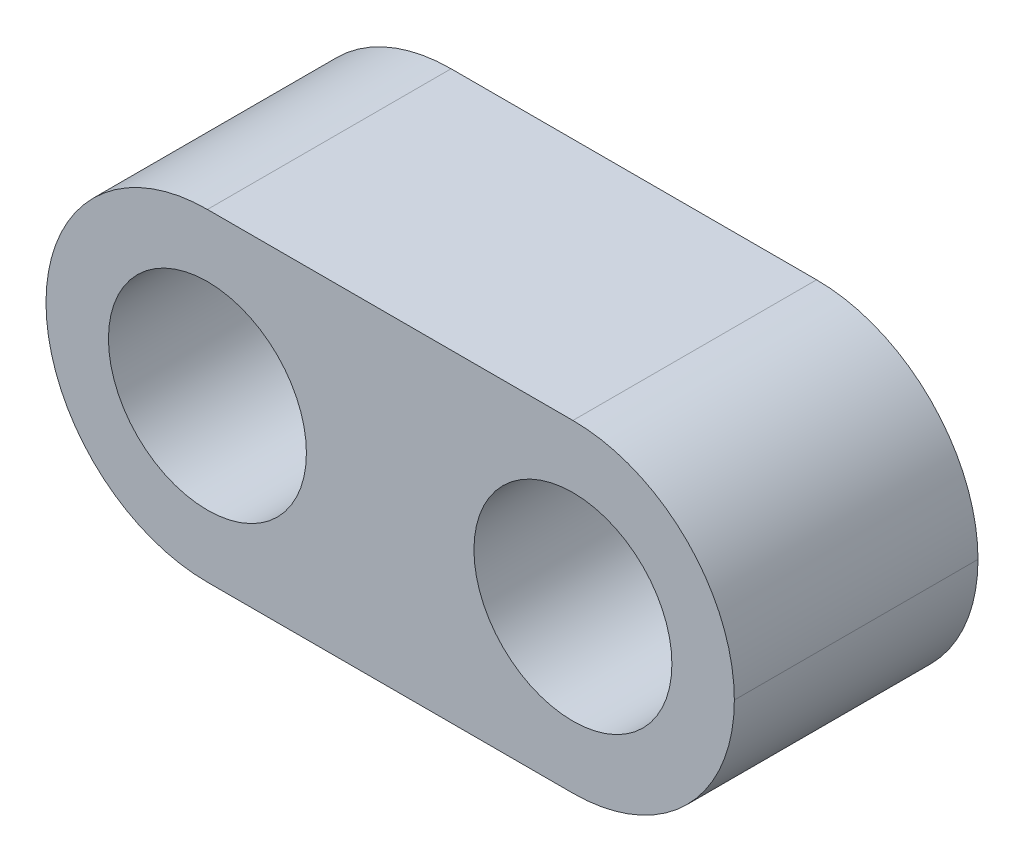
ISO-10303-21;
HEADER;
FILE_DESCRIPTION(('STEP AP214'),'2;1');
FILE_NAME('part.step','',(''),(''),'','','');
FILE_SCHEMA(('AUTOMOTIVE_DESIGN { 1 0 10303 214 1 1 1 1 }'));
ENDSEC;
DATA;
#1=APPLICATION_CONTEXT('core data for automotive mechanical design processes');
#2=APPLICATION_PROTOCOL_DEFINITION('international standard','automotive_design',2000,#1);
#3=PRODUCT_CONTEXT('',#1,'mechanical');
#4=PRODUCT('Part','Part','',(#3));
#5=PRODUCT_RELATED_PRODUCT_CATEGORY('part','',(#4));
#6=PRODUCT_DEFINITION_FORMATION('','',#4);
#7=PRODUCT_DEFINITION_CONTEXT('part definition',#1,'design');
#8=PRODUCT_DEFINITION('design','',#6,#7);
#9=PRODUCT_DEFINITION_SHAPE('','',#8);
#10=(LENGTH_UNIT() NAMED_UNIT(*) SI_UNIT(.MILLI.,.METRE.));
#11=(NAMED_UNIT(*) PLANE_ANGLE_UNIT() SI_UNIT($,.RADIAN.));
#12=(NAMED_UNIT(*) SI_UNIT($,.STERADIAN.) SOLID_ANGLE_UNIT());
#13=UNCERTAINTY_MEASURE_WITH_UNIT(LENGTH_MEASURE(1.E-05),#10,'distance_accuracy_value','');
#14=(GEOMETRIC_REPRESENTATION_CONTEXT(3) GLOBAL_UNCERTAINTY_ASSIGNED_CONTEXT((#13)) GLOBAL_UNIT_ASSIGNED_CONTEXT((#10,
#11,#12)) REPRESENTATION_CONTEXT('',''));
#15=CARTESIAN_POINT('',(0.,0.,0.));
#16=DIRECTION('',(0.,0.,1.));
#17=DIRECTION('',(1.,0.,0.));
#18=AXIS2_PLACEMENT_3D('',#15,#16,#17);
#19=CARTESIAN_POINT('',(-5.65,2.65,4.));
#20=DIRECTION('',(0.,-1.,0.));
#21=DIRECTION('',(0.,0.,-1.));
#22=AXIS2_PLACEMENT_3D('',#19,#20,#21);
#23=PLANE('',#22);
#24=DIRECTION('',(-1.,0.,0.));
#25=VECTOR('',#24,1.);
#26=CARTESIAN_POINT('',(-5.65,2.65,4.));
#27=LINE('',#26,#25);
#28=CARTESIAN_POINT('',(3.,2.65,4.));
#29=VERTEX_POINT('',#28);
#30=CARTESIAN_POINT('',(-3.,2.65,4.));
#31=VERTEX_POINT('',#30);
#32=EDGE_CURVE('E114',#29,#31,#27,.T.);
#33=ORIENTED_EDGE('',*,*,#32,.F.);
#34=DIRECTION('',(0.,0.,-1.));
#35=VECTOR('',#34,1.);
#36=CARTESIAN_POINT('',(3.,2.65,4.));
#37=LINE('',#36,#35);
#38=CARTESIAN_POINT('',(3.,2.65,0.));
#39=VERTEX_POINT('',#38);
#40=EDGE_CURVE('E98',#29,#39,#37,.T.);
#41=ORIENTED_EDGE('',*,*,#40,.T.);
#42=DIRECTION('',(-1.,0.,0.));
#43=VECTOR('',#42,1.);
#44=CARTESIAN_POINT('',(-5.65,2.65,0.));
#45=LINE('',#44,#43);
#46=CARTESIAN_POINT('',(-3.,2.65,0.));
#47=VERTEX_POINT('',#46);
#48=EDGE_CURVE('E111',#39,#47,#45,.T.);
#49=ORIENTED_EDGE('',*,*,#48,.T.);
#50=DIRECTION('',(0.,0.,-1.));
#51=VECTOR('',#50,1.);
#52=CARTESIAN_POINT('',(-3.,2.65,4.));
#53=LINE('',#52,#51);
#54=EDGE_CURVE('E117',#47,#31,#53,.F.);
#55=ORIENTED_EDGE('',*,*,#54,.T.);
#56=EDGE_LOOP('',(#33,#41,#49,#55));
#57=FACE_BOUND('',#56,.T.);
#58=ADVANCED_FACE('F39',(#57),#23,.F.);
#59=CARTESIAN_POINT('',(-5.65,-2.65,4.));
#60=DIRECTION('',(0.,1.,0.));
#61=DIRECTION('',(0.,0.,1.));
#62=AXIS2_PLACEMENT_3D('',#59,#60,#61);
#63=PLANE('',#62);
#64=DIRECTION('',(1.,0.,0.));
#65=VECTOR('',#64,1.);
#66=CARTESIAN_POINT('',(-5.65,-2.65,0.));
#67=LINE('',#66,#65);
#68=CARTESIAN_POINT('',(-3.,-2.65,0.));
#69=VERTEX_POINT('',#68);
#70=CARTESIAN_POINT('',(3.,-2.65,0.));
#71=VERTEX_POINT('',#70);
#72=EDGE_CURVE('E122',#69,#71,#67,.T.);
#73=ORIENTED_EDGE('',*,*,#72,.T.);
#74=DIRECTION('',(0.,0.,-1.));
#75=VECTOR('',#74,1.);
#76=CARTESIAN_POINT('',(3.,-2.65,4.));
#77=LINE('',#76,#75);
#78=CARTESIAN_POINT('',(3.,-2.65,4.));
#79=VERTEX_POINT('',#78);
#80=EDGE_CURVE('E11',#71,#79,#77,.F.);
#81=ORIENTED_EDGE('',*,*,#80,.T.);
#82=DIRECTION('',(1.,0.,0.));
#83=VECTOR('',#82,1.);
#84=CARTESIAN_POINT('',(-5.65,-2.65,4.));
#85=LINE('',#84,#83);
#86=CARTESIAN_POINT('',(-3.,-2.65,4.));
#87=VERTEX_POINT('',#86);
#88=EDGE_CURVE('E132',#87,#79,#85,.T.);
#89=ORIENTED_EDGE('',*,*,#88,.F.);
#90=DIRECTION('',(0.,0.,-1.));
#91=VECTOR('',#90,1.);
#92=CARTESIAN_POINT('',(-3.,-2.65,4.));
#93=LINE('',#92,#91);
#94=EDGE_CURVE('E49',#87,#69,#93,.T.);
#95=ORIENTED_EDGE('',*,*,#94,.T.);
#96=EDGE_LOOP('',(#73,#81,#89,#95));
#97=FACE_BOUND('',#96,.T.);
#98=ADVANCED_FACE('F201',(#97),#63,.F.);
#99=CARTESIAN_POINT('',(0.,0.,4.));
#100=DIRECTION('',(0.,0.,-1.));
#101=DIRECTION('',(-1.,0.,0.));
#102=AXIS2_PLACEMENT_3D('',#99,#100,#101);
#103=PLANE('',#102);
#104=CARTESIAN_POINT('',(-3.,0.,4.));
#105=DIRECTION('',(0.,0.,-1.));
#106=DIRECTION('',(-1.,0.,0.));
#107=AXIS2_PLACEMENT_3D('',#104,#105,#106);
#108=CIRCLE('',#107,1.625);
#109=CARTESIAN_POINT('',(-4.625,0.,4.));
#110=VERTEX_POINT('',#109);
#111=EDGE_CURVE('E123',#110,#110,#108,.T.);
#112=ORIENTED_EDGE('',*,*,#111,.T.);
#113=EDGE_LOOP('',(#112));
#114=FACE_BOUND('',#113,.T.);
#115=CARTESIAN_POINT('',(3.,0.,4.));
#116=DIRECTION('',(0.,0.,-1.));
#117=DIRECTION('',(-1.,0.,0.));
#118=AXIS2_PLACEMENT_3D('',#115,#116,#117);
#119=CIRCLE('',#118,1.625);
#120=CARTESIAN_POINT('',(1.375,0.,4.));
#121=VERTEX_POINT('',#120);
#122=EDGE_CURVE('E161',#121,#121,#119,.T.);
#123=ORIENTED_EDGE('',*,*,#122,.T.);
#124=EDGE_LOOP('',(#123));
#125=FACE_BOUND('',#124,.T.);
#126=CARTESIAN_POINT('',(3.,0.,4.));
#127=DIRECTION('',(0.,0.,-1.));
#128=DIRECTION('',(-1.,0.,0.));
#129=AXIS2_PLACEMENT_3D('',#126,#127,#128);
#130=CIRCLE('',#129,2.65);
#131=CARTESIAN_POINT('',(5.65,0.,4.));
#132=VERTEX_POINT('',#131);
#133=EDGE_CURVE('E148',#79,#132,#130,.F.);
#134=ORIENTED_EDGE('',*,*,#133,.T.);
#135=CARTESIAN_POINT('',(3.,0.,4.));
#136=DIRECTION('',(0.,0.,-1.));
#137=DIRECTION('',(-1.,0.,0.));
#138=AXIS2_PLACEMENT_3D('',#135,#136,#137);
#139=CIRCLE('',#138,2.65);
#140=EDGE_CURVE('E151',#132,#29,#139,.F.);
#141=ORIENTED_EDGE('',*,*,#140,.T.);
#142=ORIENTED_EDGE('',*,*,#32,.T.);
#143=CARTESIAN_POINT('',(-3.,0.,4.));
#144=DIRECTION('',(0.,0.,-1.));
#145=DIRECTION('',(-1.,0.,0.));
#146=AXIS2_PLACEMENT_3D('',#143,#144,#145);
#147=CIRCLE('',#146,2.65);
#148=CARTESIAN_POINT('',(-5.65,0.,4.));
#149=VERTEX_POINT('',#148);
#150=EDGE_CURVE('E105',#31,#149,#147,.F.);
#151=ORIENTED_EDGE('',*,*,#150,.T.);
#152=CARTESIAN_POINT('',(-3.,0.,4.));
#153=DIRECTION('',(0.,0.,-1.));
#154=DIRECTION('',(-1.,0.,0.));
#155=AXIS2_PLACEMENT_3D('',#152,#153,#154);
#156=CIRCLE('',#155,2.65);
#157=EDGE_CURVE('E62',#149,#87,#156,.F.);
#158=ORIENTED_EDGE('',*,*,#157,.T.);
#159=ORIENTED_EDGE('',*,*,#88,.T.);
#160=EDGE_LOOP('',(#134,#141,#142,#151,#158,#159));
#161=FACE_BOUND('',#160,.T.);
#162=ADVANCED_FACE('F170',(#114,#125,#161),#103,.F.);
#163=CARTESIAN_POINT('',(0.,0.,0.));
#164=DIRECTION('',(0.,0.,-1.));
#165=DIRECTION('',(-1.,0.,0.));
#166=AXIS2_PLACEMENT_3D('',#163,#164,#165);
#167=PLANE('',#166);
#168=CARTESIAN_POINT('',(-3.,0.,0.));
#169=DIRECTION('',(0.,0.,-1.));
#170=DIRECTION('',(-1.,0.,0.));
#171=AXIS2_PLACEMENT_3D('',#168,#169,#170);
#172=CIRCLE('',#171,1.625);
#173=CARTESIAN_POINT('',(-4.625,0.,0.));
#174=VERTEX_POINT('',#173);
#175=EDGE_CURVE('E129',#174,#174,#172,.T.);
#176=ORIENTED_EDGE('',*,*,#175,.F.);
#177=EDGE_LOOP('',(#176));
#178=FACE_BOUND('',#177,.T.);
#179=CARTESIAN_POINT('',(3.,0.,0.));
#180=DIRECTION('',(0.,0.,-1.));
#181=DIRECTION('',(-1.,0.,0.));
#182=AXIS2_PLACEMENT_3D('',#179,#180,#181);
#183=CIRCLE('',#182,1.625);
#184=CARTESIAN_POINT('',(1.375,0.,0.));
#185=VERTEX_POINT('',#184);
#186=EDGE_CURVE('E157',#185,#185,#183,.T.);
#187=ORIENTED_EDGE('',*,*,#186,.F.);
#188=EDGE_LOOP('',(#187));
#189=FACE_BOUND('',#188,.T.);
#190=ORIENTED_EDGE('',*,*,#48,.F.);
#191=CARTESIAN_POINT('',(3.,0.,0.));
#192=DIRECTION('',(0.,0.,-1.));
#193=DIRECTION('',(-1.,0.,0.));
#194=AXIS2_PLACEMENT_3D('',#191,#192,#193);
#195=CIRCLE('',#194,2.65);
#196=CARTESIAN_POINT('',(5.65,0.,0.));
#197=VERTEX_POINT('',#196);
#198=EDGE_CURVE('E94',#39,#197,#195,.T.);
#199=ORIENTED_EDGE('',*,*,#198,.T.);
#200=CARTESIAN_POINT('',(3.,0.,0.));
#201=DIRECTION('',(0.,0.,-1.));
#202=DIRECTION('',(-1.,0.,0.));
#203=AXIS2_PLACEMENT_3D('',#200,#201,#202);
#204=CIRCLE('',#203,2.65);
#205=EDGE_CURVE('E106',#197,#71,#204,.T.);
#206=ORIENTED_EDGE('',*,*,#205,.T.);
#207=ORIENTED_EDGE('',*,*,#72,.F.);
#208=CARTESIAN_POINT('',(-3.,0.,0.));
#209=DIRECTION('',(0.,0.,-1.));
#210=DIRECTION('',(-1.,0.,0.));
#211=AXIS2_PLACEMENT_3D('',#208,#209,#210);
#212=CIRCLE('',#211,2.65);
#213=CARTESIAN_POINT('',(-5.65,0.,0.));
#214=VERTEX_POINT('',#213);
#215=EDGE_CURVE('E139',#69,#214,#212,.T.);
#216=ORIENTED_EDGE('',*,*,#215,.T.);
#217=CARTESIAN_POINT('',(-3.,0.,0.));
#218=DIRECTION('',(0.,0.,-1.));
#219=DIRECTION('',(-1.,0.,0.));
#220=AXIS2_PLACEMENT_3D('',#217,#218,#219);
#221=CIRCLE('',#220,2.65);
#222=EDGE_CURVE('E116',#214,#47,#221,.T.);
#223=ORIENTED_EDGE('',*,*,#222,.T.);
#224=EDGE_LOOP('',(#190,#199,#206,#207,#216,#223));
#225=FACE_BOUND('',#224,.T.);
#226=ADVANCED_FACE('F119',(#178,#189,#225),#167,.T.);
#227=CARTESIAN_POINT('',(3.,0.,4.));
#228=DIRECTION('',(0.,0.,-1.));
#229=DIRECTION('',(-1.,0.,0.));
#230=AXIS2_PLACEMENT_3D('',#227,#228,#229);
#231=CYLINDRICAL_SURFACE('',#230,1.625);
#232=ORIENTED_EDGE('',*,*,#122,.F.);
#233=EDGE_LOOP('',(#232));
#234=FACE_BOUND('',#233,.T.);
#235=ORIENTED_EDGE('',*,*,#186,.T.);
#236=EDGE_LOOP('',(#235));
#237=FACE_BOUND('',#236,.T.);
#238=ADVANCED_FACE('F185',(#234,#237),#231,.F.);
#239=CARTESIAN_POINT('',(-3.,0.,4.));
#240=DIRECTION('',(0.,0.,-1.));
#241=DIRECTION('',(-1.,0.,0.));
#242=AXIS2_PLACEMENT_3D('',#239,#240,#241);
#243=CYLINDRICAL_SURFACE('',#242,1.625);
#244=ORIENTED_EDGE('',*,*,#111,.F.);
#245=EDGE_LOOP('',(#244));
#246=FACE_BOUND('',#245,.T.);
#247=ORIENTED_EDGE('',*,*,#175,.T.);
#248=EDGE_LOOP('',(#247));
#249=FACE_BOUND('',#248,.T.);
#250=ADVANCED_FACE('F181',(#246,#249),#243,.F.);
#251=CARTESIAN_POINT('',(3.,0.,4.));
#252=DIRECTION('',(0.,0.,-1.));
#253=DIRECTION('',(-1.,0.,0.));
#254=AXIS2_PLACEMENT_3D('',#251,#252,#253);
#255=CYLINDRICAL_SURFACE('',#254,2.65);
#256=DIRECTION('',(0.,0.,-1.));
#257=VECTOR('',#256,1.);
#258=CARTESIAN_POINT('',(5.65,0.,4.));
#259=LINE('',#258,#257);
#260=EDGE_CURVE('E100',#132,#197,#259,.T.);
#261=ORIENTED_EDGE('',*,*,#260,.F.);
#262=ORIENTED_EDGE('',*,*,#133,.F.);
#263=ORIENTED_EDGE('',*,*,#80,.F.);
#264=ORIENTED_EDGE('',*,*,#205,.F.);
#265=EDGE_LOOP('',(#261,#262,#263,#264));
#266=FACE_BOUND('',#265,.T.);
#267=ADVANCED_FACE('F195',(#266),#255,.T.);
#268=CARTESIAN_POINT('',(3.,0.,4.));
#269=DIRECTION('',(0.,0.,-1.));
#270=DIRECTION('',(-1.,0.,0.));
#271=AXIS2_PLACEMENT_3D('',#268,#269,#270);
#272=CYLINDRICAL_SURFACE('',#271,2.65);
#273=ORIENTED_EDGE('',*,*,#140,.F.);
#274=ORIENTED_EDGE('',*,*,#260,.T.);
#275=ORIENTED_EDGE('',*,*,#198,.F.);
#276=ORIENTED_EDGE('',*,*,#40,.F.);
#277=EDGE_LOOP('',(#273,#274,#275,#276));
#278=FACE_BOUND('',#277,.T.);
#279=ADVANCED_FACE('F97',(#278),#272,.T.);
#280=CARTESIAN_POINT('',(-3.,0.,4.));
#281=DIRECTION('',(0.,0.,-1.));
#282=DIRECTION('',(-1.,0.,0.));
#283=AXIS2_PLACEMENT_3D('',#280,#281,#282);
#284=CYLINDRICAL_SURFACE('',#283,2.65);
#285=DIRECTION('',(0.,0.,-1.));
#286=VECTOR('',#285,1.);
#287=CARTESIAN_POINT('',(-5.65,0.,4.));
#288=LINE('',#287,#286);
#289=EDGE_CURVE('E43',#149,#214,#288,.T.);
#290=ORIENTED_EDGE('',*,*,#289,.F.);
#291=ORIENTED_EDGE('',*,*,#150,.F.);
#292=ORIENTED_EDGE('',*,*,#54,.F.);
#293=ORIENTED_EDGE('',*,*,#222,.F.);
#294=EDGE_LOOP('',(#290,#291,#292,#293));
#295=FACE_BOUND('',#294,.T.);
#296=ADVANCED_FACE('F41',(#295),#284,.T.);
#297=CARTESIAN_POINT('',(-3.,0.,4.));
#298=DIRECTION('',(0.,0.,-1.));
#299=DIRECTION('',(-1.,0.,0.));
#300=AXIS2_PLACEMENT_3D('',#297,#298,#299);
#301=CYLINDRICAL_SURFACE('',#300,2.65);
#302=ORIENTED_EDGE('',*,*,#157,.F.);
#303=ORIENTED_EDGE('',*,*,#289,.T.);
#304=ORIENTED_EDGE('',*,*,#215,.F.);
#305=ORIENTED_EDGE('',*,*,#94,.F.);
#306=EDGE_LOOP('',(#302,#303,#304,#305));
#307=FACE_BOUND('',#306,.T.);
#308=ADVANCED_FACE('F166',(#307),#301,.T.);
#309=CLOSED_SHELL('',(#58,#98,#162,#226,#238,#250,#267,#279,#296,#308));
#310=MANIFOLD_SOLID_BREP('B2',#309);
#311=ADVANCED_BREP_SHAPE_REPRESENTATION('',(#18,#310),#14);
#312=SHAPE_DEFINITION_REPRESENTATION(#9,#311);
ENDSEC;
END-ISO-10303-21;
